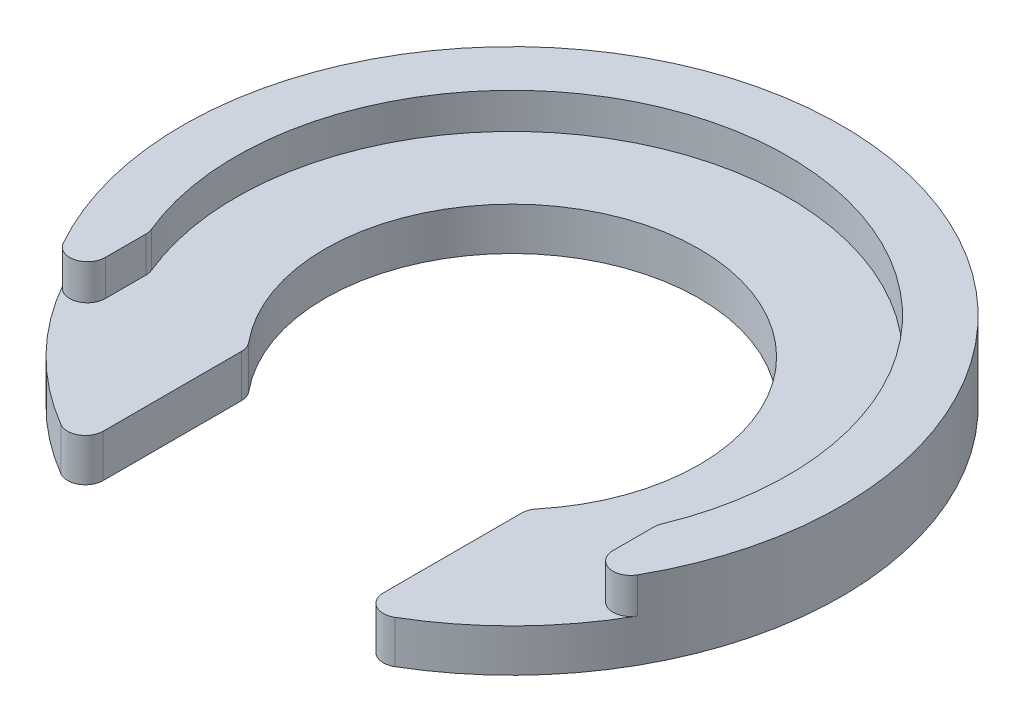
from build123d import *

# Parameters (mm, degrees)
ENL_V_MAT_EXTRU_1_DEPTH      = 27.272799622
ENL_V_MAT_EXTRU_1_DEPTH_BACK = 27.272799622
ENL_V_MAT_EXTRU_2_DEPTH      = 10
CONG_2_R                     = 1


with BuildPart() as part:
    # Esquisse1 → R_volution1 (revolve)
    with BuildSketch(Plane.XY, mode=Mode.PRIVATE) as r_volution1_sk:
        Polygon((-18.5, 0), (-10.5, 0), (-10.5, 2.4), (-15.5, 2.4), (-15.5, 4.4), (-18.5, 4.4), align=None)
    revolve(r_volution1_sk.sketch.rotate(Axis((0, 0, 0), (0, 1, 0)), 270), axis=Axis((0, 0, 0), (0, 1, 0)))

    # Esquisse2 → Enl_v. mat.-Extru.1 (cut, two sides: drawn at the far end of the back side and taken through both)
    with BuildSketch(Plane(origin=(0, 2.4, 0), x_dir=(1, 0, 0), z_dir=(0, 1, 0)).offset(-ENL_V_MAT_EXTRU_1_DEPTH_BACK)):
        with BuildLine():
            Line((7.861405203, 0), (7.861405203, -20.387244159))
            ThreePointArc((7.861405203, -20.387244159), (0, -28.248649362), (-7.861405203, -20.387244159))
            Line((-7.861405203, -20.387244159), (-7.861405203, 0))
            ThreePointArc((-7.861405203, 0), (0, 7.861405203), (7.861405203, 0))
        make_face()
    extrude(amount=ENL_V_MAT_EXTRU_1_DEPTH + ENL_V_MAT_EXTRU_1_DEPTH_BACK, mode=Mode.SUBTRACT)

    # Esquisse3 → Enl_v. mat.-Extru.2 (cut)
    with BuildSketch(Plane(origin=(0, 2.4, 0), x_dir=(1, 0, 0), z_dir=(0, 1, 0))):
        with BuildLine():
            Line((14.25, 0), (14.25, -18.50050691))
            ThreePointArc((14.25, -18.50050691), (0, -32.75050691), (-14.25, -18.50050691))
            Line((-14.25, -18.50050691), (-14.25, 0))
            ThreePointArc((-14.25, 0), (0, 14.25), (14.25, 0))
        make_face()
    extrude(amount=ENL_V_MAT_EXTRU_2_DEPTH, mode=Mode.SUBTRACT)

    # Cong_2
    cong_2_edges = [part.edges().sort_by_distance(p)[0] for p in [
        (7.861405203, 1.2, 6.960481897),
        (-7.861405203, 1.2, 16.746590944),
        (-7.861405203, 1.2, 6.960481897),
        (7.861405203, 1.2, 16.746590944),
        (-14.25, 3.4, 11.797775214),
        (-14.25, 3.4, 6.098155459),
        (14.25, 3.4, 11.797775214),
        (14.25, 3.4, 6.098155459),
    ]]
    fillet(cong_2_edges, radius=CONG_2_R)


solid = part.part
